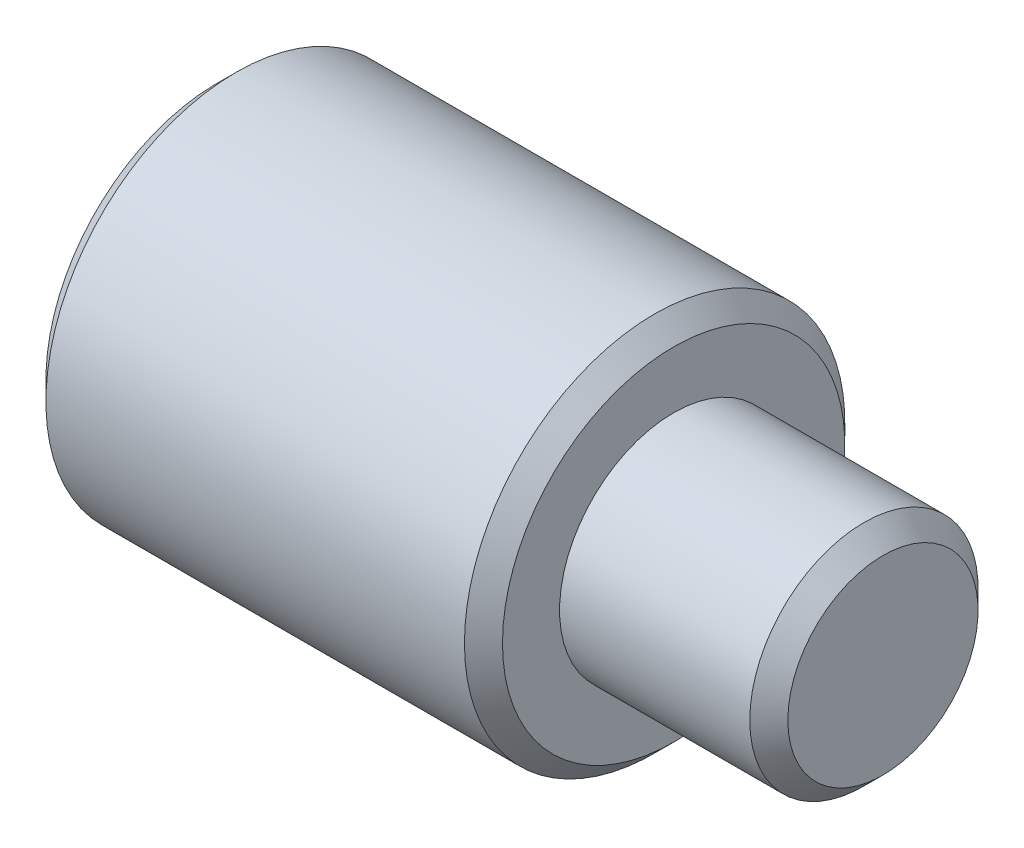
ISO-10303-21;
HEADER;
FILE_DESCRIPTION(('STEP AP214'),'2;1');
FILE_NAME('part.step','',(''),(''),'','','');
FILE_SCHEMA(('AUTOMOTIVE_DESIGN { 1 0 10303 214 1 1 1 1 }'));
ENDSEC;
DATA;
#1=APPLICATION_CONTEXT('core data for automotive mechanical design processes');
#2=APPLICATION_PROTOCOL_DEFINITION('international standard','automotive_design',2000,#1);
#3=PRODUCT_CONTEXT('',#1,'mechanical');
#4=PRODUCT('Part','Part','',(#3));
#5=PRODUCT_RELATED_PRODUCT_CATEGORY('part','',(#4));
#6=PRODUCT_DEFINITION_FORMATION('','',#4);
#7=PRODUCT_DEFINITION_CONTEXT('part definition',#1,'design');
#8=PRODUCT_DEFINITION('design','',#6,#7);
#9=PRODUCT_DEFINITION_SHAPE('','',#8);
#10=(LENGTH_UNIT() NAMED_UNIT(*) SI_UNIT(.MILLI.,.METRE.));
#11=(NAMED_UNIT(*) PLANE_ANGLE_UNIT() SI_UNIT($,.RADIAN.));
#12=(NAMED_UNIT(*) SI_UNIT($,.STERADIAN.) SOLID_ANGLE_UNIT());
#13=UNCERTAINTY_MEASURE_WITH_UNIT(LENGTH_MEASURE(1.E-05),#10,'distance_accuracy_value','');
#14=(GEOMETRIC_REPRESENTATION_CONTEXT(3) GLOBAL_UNCERTAINTY_ASSIGNED_CONTEXT((#13)) GLOBAL_UNIT_ASSIGNED_CONTEXT((#10,
#11,#12)) REPRESENTATION_CONTEXT('',''));
#15=CARTESIAN_POINT('',(0.,0.,0.));
#16=DIRECTION('',(0.,0.,1.));
#17=DIRECTION('',(1.,0.,0.));
#18=AXIS2_PLACEMENT_3D('',#15,#16,#17);
#19=CARTESIAN_POINT('',(17.5,0.,0.));
#20=DIRECTION('',(1.,0.,0.));
#21=DIRECTION('',(0.,1.,0.));
#22=AXIS2_PLACEMENT_3D('',#19,#20,#21);
#23=PLANE('',#22);
#24=CARTESIAN_POINT('',(17.4999999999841,0.,0.));
#25=DIRECTION('',(-1.,0.,0.));
#26=DIRECTION('',(0.,0.,1.));
#27=AXIS2_PLACEMENT_3D('',#24,#25,#26);
#28=CIRCLE('',#27,2.49999999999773);
#29=CARTESIAN_POINT('',(17.4999999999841,0.,2.49999999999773));
#30=VERTEX_POINT('',#29);
#31=EDGE_CURVE('E19',#30,#30,#28,.T.);
#32=ORIENTED_EDGE('',*,*,#31,.F.);
#33=EDGE_LOOP('',(#32));
#34=FACE_BOUND('',#33,.T.);
#35=ADVANCED_FACE('F16',(#34),#23,.T.);
#36=CARTESIAN_POINT('',(6.00000000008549,0.,0.));
#37=DIRECTION('',(-1.,0.,0.));
#38=DIRECTION('',(0.,-1.,0.));
#39=AXIS2_PLACEMENT_3D('',#36,#37,#38);
#40=CONICAL_SURFACE('',#39,1.6499999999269,1.0297442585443);
#41=CARTESIAN_POINT('',(6.99142002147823,0.,-2.55795384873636E-10));
#42=VERTEX_POINT('',#41);
#43=VERTEX_LOOP('',#42);
#44=FACE_BOUND('',#43,.T.);
#45=CARTESIAN_POINT('',(6.00000000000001,0.,0.));
#46=DIRECTION('',(1.,0.,0.));
#47=DIRECTION('',(0.,1.,0.));
#48=AXIS2_PLACEMENT_3D('',#45,#46,#47);
#49=CIRCLE('',#48,1.65);
#50=CARTESIAN_POINT('',(6.00000000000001,1.65,0.));
#51=VERTEX_POINT('',#50);
#52=EDGE_CURVE('E33',#51,#51,#49,.F.);
#53=ORIENTED_EDGE('',*,*,#52,.T.);
#54=EDGE_LOOP('',(#53));
#55=FACE_BOUND('',#54,.T.);
#56=ADVANCED_FACE('F27',(#44,#55),#40,.F.);
#57=CARTESIAN_POINT('',(17.0000000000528,0.,0.));
#58=DIRECTION('',(-1.,0.,0.));
#59=DIRECTION('',(0.,0.,1.));
#60=AXIS2_PLACEMENT_3D('',#57,#58,#59);
#61=CONICAL_SURFACE('',#60,2.99999999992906,0.785398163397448);
#62=CARTESIAN_POINT('',(17.,0.,0.));
#63=DIRECTION('',(1.,0.,0.));
#64=DIRECTION('',(0.,1.,0.));
#65=AXIS2_PLACEMENT_3D('',#62,#63,#64);
#66=CIRCLE('',#65,3.);
#67=CARTESIAN_POINT('',(17.,3.,0.));
#68=VERTEX_POINT('',#67);
#69=EDGE_CURVE('E35',#68,#68,#66,.F.);
#70=ORIENTED_EDGE('',*,*,#69,.F.);
#71=EDGE_LOOP('',(#70));
#72=FACE_BOUND('',#71,.T.);
#73=ORIENTED_EDGE('',*,*,#31,.T.);
#74=EDGE_LOOP('',(#73));
#75=FACE_BOUND('',#74,.T.);
#76=ADVANCED_FACE('F30',(#72,#75),#61,.T.);
#77=CARTESIAN_POINT('',(-0.874999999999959,0.,0.));
#78=DIRECTION('',(1.,0.,0.));
#79=DIRECTION('',(0.,1.,0.));
#80=AXIS2_PLACEMENT_3D('',#77,#78,#79);
#81=CYLINDRICAL_SURFACE('',#80,1.65);
#82=ORIENTED_EDGE('',*,*,#52,.F.);
#83=EDGE_LOOP('',(#82));
#84=FACE_BOUND('',#83,.T.);
#85=CARTESIAN_POINT('',(0.,0.,0.));
#86=DIRECTION('',(1.,0.,0.));
#87=DIRECTION('',(0.,1.,0.));
#88=AXIS2_PLACEMENT_3D('',#85,#86,#87);
#89=CIRCLE('',#88,1.65);
#90=CARTESIAN_POINT('',(0.,1.65,0.));
#91=VERTEX_POINT('',#90);
#92=EDGE_CURVE('E38',#91,#91,#89,.F.);
#93=ORIENTED_EDGE('',*,*,#92,.T.);
#94=EDGE_LOOP('',(#93));
#95=FACE_BOUND('',#94,.T.);
#96=ADVANCED_FACE('F54',(#84,#95),#81,.F.);
#97=CARTESIAN_POINT('',(-0.874999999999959,0.,0.));
#98=DIRECTION('',(1.,0.,0.));
#99=DIRECTION('',(0.,1.,0.));
#100=AXIS2_PLACEMENT_3D('',#97,#98,#99);
#101=CYLINDRICAL_SURFACE('',#100,3.);
#102=ORIENTED_EDGE('',*,*,#69,.T.);
#103=EDGE_LOOP('',(#102));
#104=FACE_BOUND('',#103,.T.);
#105=CARTESIAN_POINT('',(12.,0.,0.));
#106=DIRECTION('',(1.,0.,0.));
#107=DIRECTION('',(0.,1.,0.));
#108=AXIS2_PLACEMENT_3D('',#105,#106,#107);
#109=CIRCLE('',#108,3.);
#110=CARTESIAN_POINT('',(12.,3.,0.));
#111=VERTEX_POINT('',#110);
#112=EDGE_CURVE('E49',#111,#111,#109,.F.);
#113=ORIENTED_EDGE('',*,*,#112,.F.);
#114=EDGE_LOOP('',(#113));
#115=FACE_BOUND('',#114,.T.);
#116=ADVANCED_FACE('F59',(#104,#115),#101,.T.);
#117=CARTESIAN_POINT('',(0.,0.,0.));
#118=DIRECTION('',(1.,0.,0.));
#119=DIRECTION('',(0.,1.,0.));
#120=AXIS2_PLACEMENT_3D('',#117,#118,#119);
#121=PLANE('',#120);
#122=CARTESIAN_POINT('',(-1.13686837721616E-10,0.,0.));
#123=DIRECTION('',(1.,0.,0.));
#124=DIRECTION('',(0.,0.,-1.));
#125=AXIS2_PLACEMENT_3D('',#122,#123,#124);
#126=CIRCLE('',#125,4.50000000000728);
#127=CARTESIAN_POINT('',(-1.13686837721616E-10,0.,-4.50000000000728));
#128=VERTEX_POINT('',#127);
#129=EDGE_CURVE('E46',#128,#128,#126,.T.);
#130=ORIENTED_EDGE('',*,*,#129,.F.);
#131=EDGE_LOOP('',(#130));
#132=FACE_BOUND('',#131,.T.);
#133=ORIENTED_EDGE('',*,*,#92,.F.);
#134=EDGE_LOOP('',(#133));
#135=FACE_BOUND('',#134,.T.);
#136=ADVANCED_FACE('F56',(#132,#135),#121,.F.);
#137=CARTESIAN_POINT('',(12.,0.,0.));
#138=DIRECTION('',(1.,0.,0.));
#139=DIRECTION('',(0.,1.,0.));
#140=AXIS2_PLACEMENT_3D('',#137,#138,#139);
#141=PLANE('',#140);
#142=CARTESIAN_POINT('',(11.9999999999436,0.,0.));
#143=DIRECTION('',(-1.,0.,0.));
#144=DIRECTION('',(0.,0.,1.));
#145=AXIS2_PLACEMENT_3D('',#142,#143,#144);
#146=CIRCLE('',#145,4.50000000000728);
#147=CARTESIAN_POINT('',(11.9999999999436,0.,4.50000000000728));
#148=VERTEX_POINT('',#147);
#149=EDGE_CURVE('E43',#148,#148,#146,.T.);
#150=ORIENTED_EDGE('',*,*,#149,.F.);
#151=EDGE_LOOP('',(#150));
#152=FACE_BOUND('',#151,.T.);
#153=ORIENTED_EDGE('',*,*,#112,.T.);
#154=EDGE_LOOP('',(#153));
#155=FACE_BOUND('',#154,.T.);
#156=ADVANCED_FACE('F58',(#152,#155),#141,.T.);
#157=CARTESIAN_POINT('',(0.499999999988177,0.,0.));
#158=DIRECTION('',(1.,0.,0.));
#159=DIRECTION('',(0.,0.,-1.));
#160=AXIS2_PLACEMENT_3D('',#157,#158,#159);
#161=CONICAL_SURFACE('',#160,5.00000000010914,0.785398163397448);
#162=CARTESIAN_POINT('',(0.499999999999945,0.,0.));
#163=DIRECTION('',(1.,0.,0.));
#164=DIRECTION('',(0.,1.,0.));
#165=AXIS2_PLACEMENT_3D('',#162,#163,#164);
#166=CIRCLE('',#165,5.);
#167=CARTESIAN_POINT('',(0.499999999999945,5.,0.));
#168=VERTEX_POINT('',#167);
#169=EDGE_CURVE('E23',#168,#168,#166,.T.);
#170=ORIENTED_EDGE('',*,*,#169,.F.);
#171=EDGE_LOOP('',(#170));
#172=FACE_BOUND('',#171,.T.);
#173=ORIENTED_EDGE('',*,*,#129,.T.);
#174=EDGE_LOOP('',(#173));
#175=FACE_BOUND('',#174,.T.);
#176=ADVANCED_FACE('F67',(#172,#175),#161,.T.);
#177=CARTESIAN_POINT('',(11.5000000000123,0.,0.));
#178=DIRECTION('',(-1.,0.,0.));
#179=DIRECTION('',(0.,0.,1.));
#180=AXIS2_PLACEMENT_3D('',#177,#178,#179);
#181=CONICAL_SURFACE('',#180,4.99999999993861,0.785398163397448);
#182=CARTESIAN_POINT('',(11.5,0.,0.));
#183=DIRECTION('',(1.,0.,0.));
#184=DIRECTION('',(0.,1.,0.));
#185=AXIS2_PLACEMENT_3D('',#182,#183,#184);
#186=CIRCLE('',#185,5.);
#187=CARTESIAN_POINT('',(11.5,5.,0.));
#188=VERTEX_POINT('',#187);
#189=EDGE_CURVE('E11',#188,#188,#186,.F.);
#190=ORIENTED_EDGE('',*,*,#189,.F.);
#191=EDGE_LOOP('',(#190));
#192=FACE_BOUND('',#191,.T.);
#193=ORIENTED_EDGE('',*,*,#149,.T.);
#194=EDGE_LOOP('',(#193));
#195=FACE_BOUND('',#194,.T.);
#196=ADVANCED_FACE('F75',(#192,#195),#181,.T.);
#197=CARTESIAN_POINT('',(-0.874999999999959,0.,0.));
#198=DIRECTION('',(1.,0.,0.));
#199=DIRECTION('',(0.,1.,0.));
#200=AXIS2_PLACEMENT_3D('',#197,#198,#199);
#201=CYLINDRICAL_SURFACE('',#200,5.);
#202=ORIENTED_EDGE('',*,*,#189,.T.);
#203=EDGE_LOOP('',(#202));
#204=FACE_BOUND('',#203,.T.);
#205=ORIENTED_EDGE('',*,*,#169,.T.);
#206=EDGE_LOOP('',(#205));
#207=FACE_BOUND('',#206,.T.);
#208=ADVANCED_FACE('F73',(#204,#207),#201,.T.);
#209=CLOSED_SHELL('',(#35,#56,#76,#96,#116,#136,#156,#176,#196,#208));
#210=MANIFOLD_SOLID_BREP('B1',#209);
#211=ADVANCED_BREP_SHAPE_REPRESENTATION('',(#18,#210),#14);
#212=SHAPE_DEFINITION_REPRESENTATION(#9,#211);
ENDSEC;
END-ISO-10303-21;
